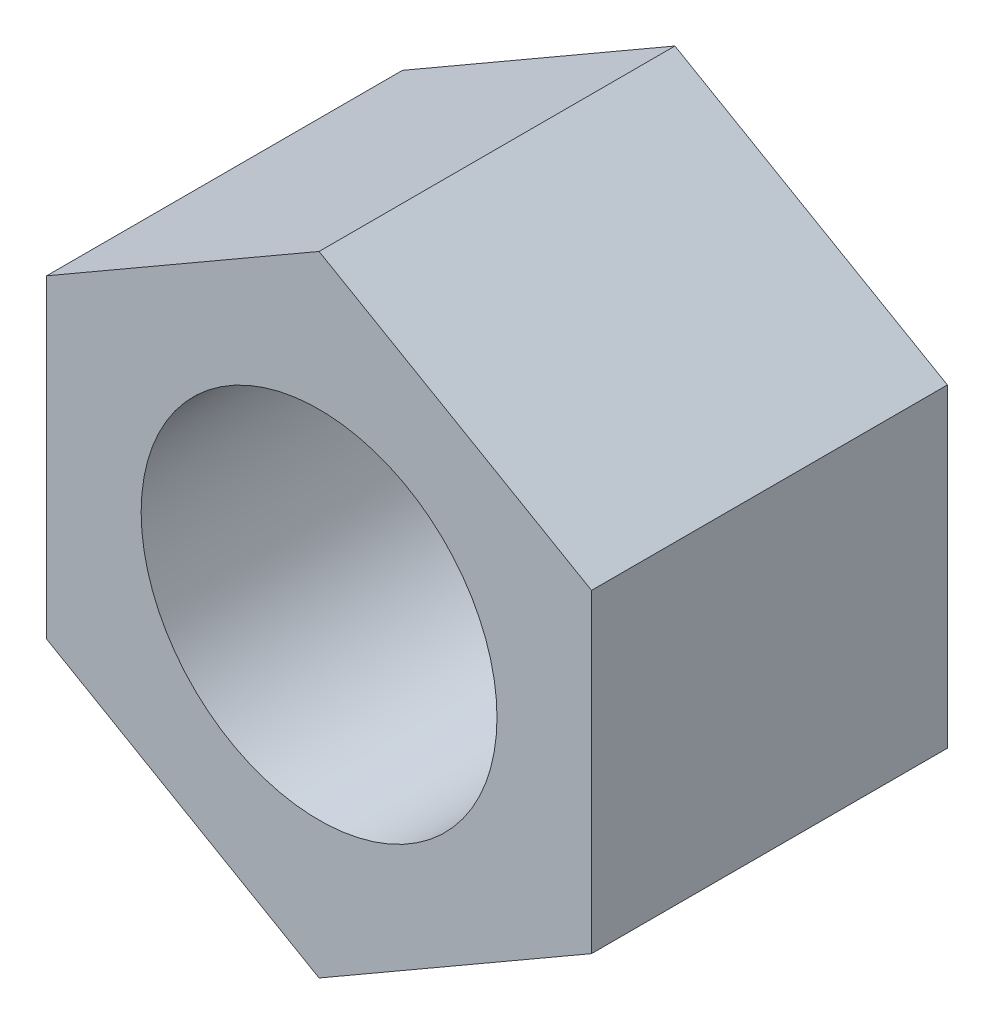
from build123d import *

# Parameters (mm, degrees)
SKETCH1_R           = 25.4
BOSS_EXTRUDE1_DEPTH = 25.4


with BuildPart() as part:
    # Sketch1 → Boss-Extrude1 (new, symmetric)
    with BuildSketch(Plane(origin=(0, 0, 0), x_dir=(0, 1, 0), z_dir=(0, 0, 1))):
        Polygon((22.455317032, -38.89375), (44.910634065, 0), (22.455317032, 38.89375), (-22.455317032, 38.89375), (-44.910634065, 0), (-22.455317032, -38.89375), align=None)
        with Locations(Location((0, 0, 0), (0, 0, 270))):
            Circle(SKETCH1_R, mode=Mode.SUBTRACT)
    extrude(amount=BOSS_EXTRUDE1_DEPTH, both=True)


solid = part.part
